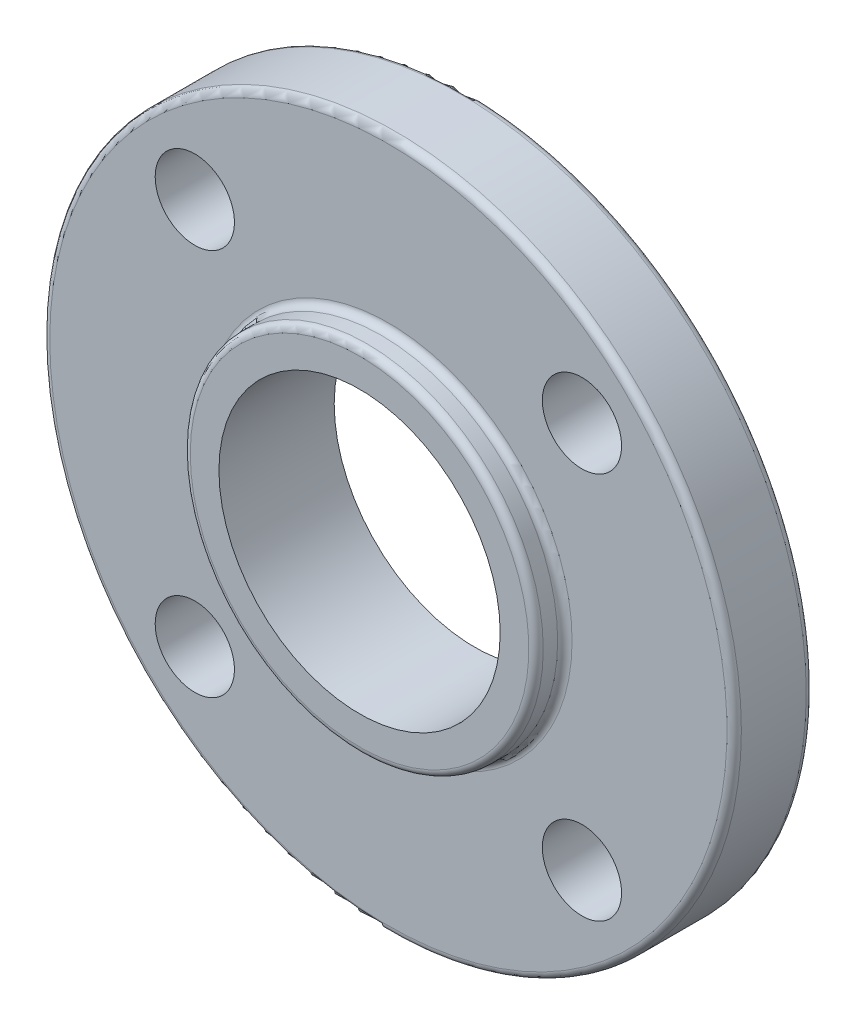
from build123d import *

# Parameters (mm, degrees)
SKETCH2_R          = 8.73125
CUT_EXTRUDE1_DEPTH = 17.4625
CIRPATTERN1_COUNT  = 4


with BuildPart() as part:
    # Sketch1 → Base-Revolve (revolve)
    with BuildSketch(Plane(origin=(0, 0, 0), x_dir=(1, 0, 0), z_dir=(0, 1, 0)), mode=Mode.PRIVATE) as base_revolve_sk:
        with BuildLine():
            Line((30.988, -25.4), (30.988, 0))
            Line((30.988, 0), (46.0375, 0))
            Line((46.0375, 0), (46.0375, -0.0635))
            ThreePointArc((46.0375, -0.0635), (46.483869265, -1.141130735), (47.5615, -1.5875))
            Line((47.5615, -1.5875), (74.6125, -1.5875))
            ThreePointArc((74.6125, -1.5875), (75.735032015, -2.052467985), (76.2, -3.175))
            Line((76.2, -3.175), (76.2, -17.4625))
            ThreePointArc((76.2, -17.4625), (75.735032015, -18.585032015), (74.6125, -19.05))
            Line((74.6125, -19.05), (40.48125, -19.05))
            ThreePointArc((40.48125, -19.05), (39.358717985, -19.514967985), (38.89375, -20.6375))
            Line((38.89375, -20.6375), (38.89375, -23.8125))
            ThreePointArc((38.89375, -23.8125), (38.428782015, -24.935032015), (37.30625, -25.4))
            Line((37.30625, -25.4), (30.988, -25.4))
        make_face()
    revolve(base_revolve_sk.sketch.rotate(Axis((0, 0, -94.093731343), (0, 0, 1)), 180), axis=Axis((0, 0, -94.093731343), (0, 0, 1)))

    # Sketch2 → Cut-Extrude1 (cut)
    with BuildSketch(Plane(origin=(0, 0, 1.5875), x_dir=(-1, 0, 0), z_dir=(0, 0, -1))):
        with Locations((42.656216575, 42.656216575)):
            Circle(SKETCH2_R)
    cut_extrude1 = extrude(amount=-CUT_EXTRUDE1_DEPTH, mode=Mode.SUBTRACT)

    # CirPattern1: Cut-Extrude1 ×4 about axis
    cirpattern1_axis = Axis((0, 0, 0), (0, 0, 1))
    for i in range(1, CIRPATTERN1_COUNT):
        add(cut_extrude1.rotate(cirpattern1_axis, i * 360 / CIRPATTERN1_COUNT), mode=Mode.SUBTRACT)


solid = part.part
